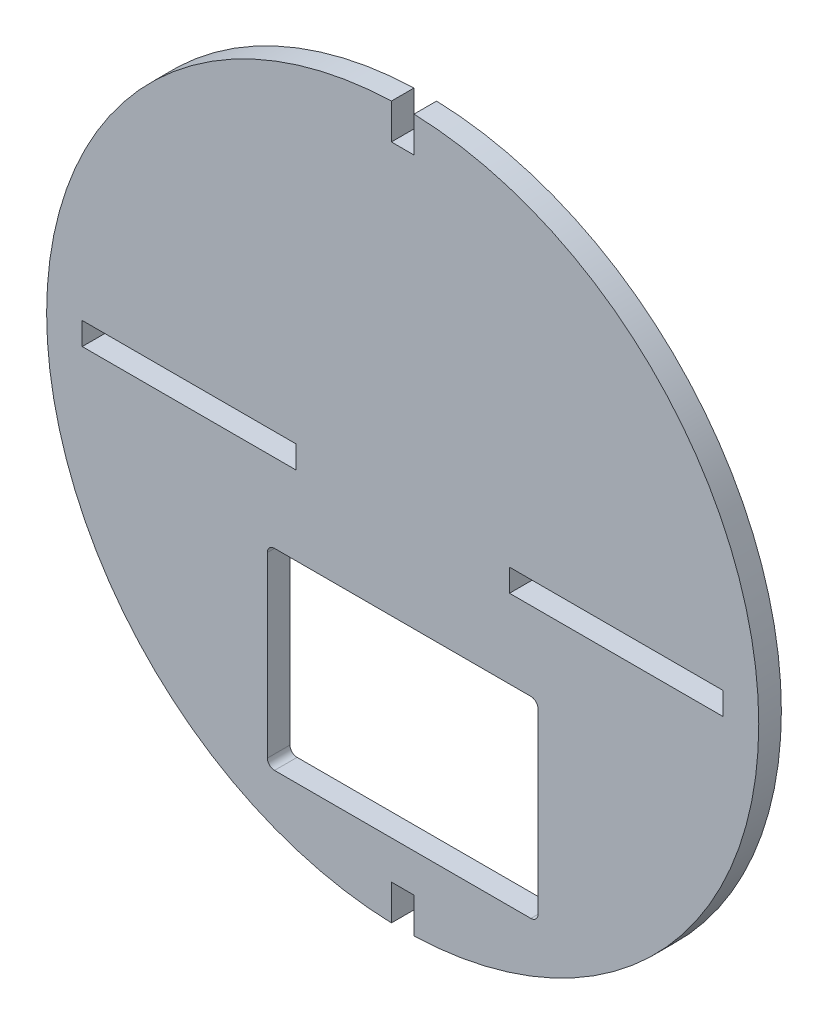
from build123d import *

# Parameters (mm, degrees)
SKETCH2_W           = 30
SKETCH2_H           = 3.175
BOSS_EXTRUDE1_DEPTH = 3.175


with BuildPart() as part:
    # Sketch2 → Boss-Extrude1 (new body)
    with BuildSketch(Plane.XY):
        with BuildLine():
            Line((-1.5875, -49.974792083), (-1.5875, -45))
            Line((-1.5875, -45), (1.5875, -45))
            Line((1.5875, -45), (1.5875, -49.974792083))
            ThreePointArc((1.5875, -49.974792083), (50, 0), (1.5875, 49.974792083))
            Line((1.5875, 49.974792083), (1.5875, 45))
            Line((1.5875, 45), (-1.5875, 45))
            Line((-1.5875, 45), (-1.5875, 49.974792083))
            ThreePointArc((-1.5875, 49.974792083), (-50, 0), (-1.5875, -49.974792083))
        make_face()
        with Locations((-30, 0)):
            Rectangle(SKETCH2_W, SKETCH2_H, mode=Mode.SUBTRACT)
        with Locations((30, 0)):
            Rectangle(SKETCH2_W, SKETCH2_H, mode=Mode.SUBTRACT)
        with BuildLine():
            Line((-18, -12.630059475), (18, -12.630059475))
            ThreePointArc((18, -12.630059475), (18.707106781, -12.922952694), (19, -13.630059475))
            Line((19, -13.630059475), (19, -38.630059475))
            ThreePointArc((19, -38.630059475), (18.707106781, -39.337166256), (18, -39.630059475))
            Line((18, -39.630059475), (-18, -39.630059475))
            ThreePointArc((-18, -39.630059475), (-18.707106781, -39.337166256), (-19, -38.630059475))
            Line((-19, -38.630059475), (-19, -13.630059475))
            ThreePointArc((-19, -13.630059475), (-18.707106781, -12.922952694), (-18, -12.630059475))
        make_face(mode=Mode.SUBTRACT)
    extrude(amount=BOSS_EXTRUDE1_DEPTH)


solid = part.part
